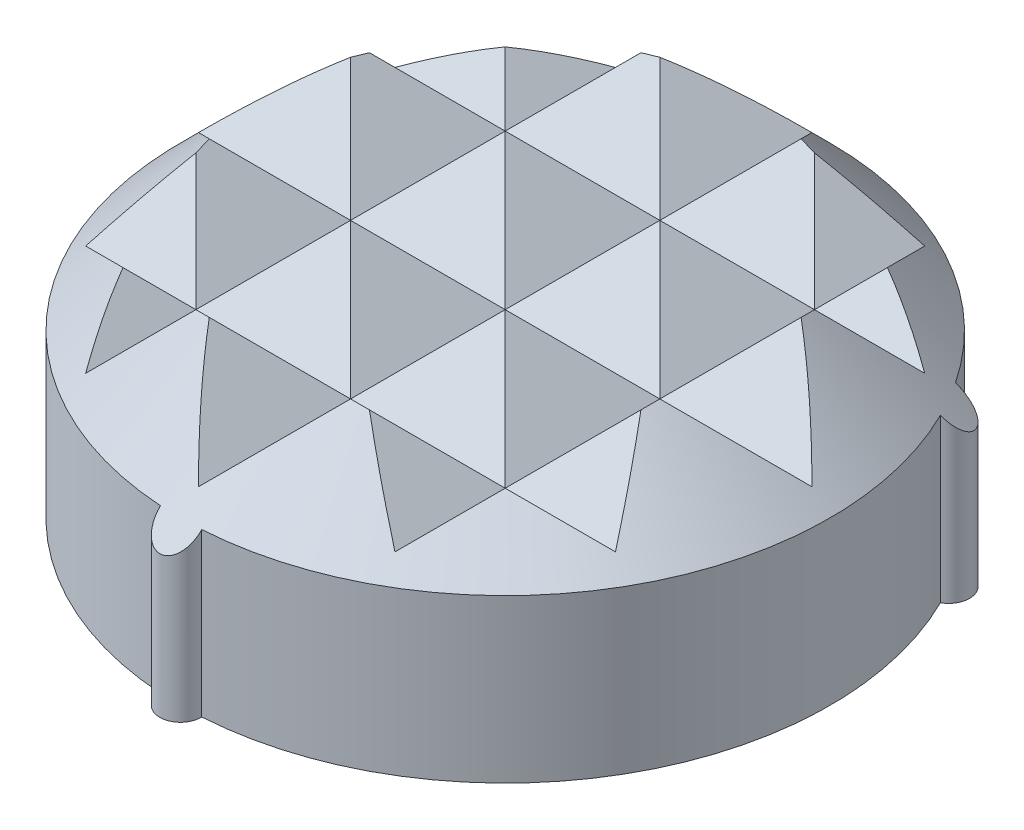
from build123d import *

# Parameters (mm, degrees)
SKETCH1_W             = 6.7
SKETCH1_H             = 5
SKETCH2_R             = 7.2
EXTRUDE1_DEPTH        = 11.713542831
EXTRUDE2_DEPTH        = 11.46804679
LPATTERN1_COUNT       = 8
LPATTERN1_PITCH       = 3
LPATTERN1_COUNT_DIR2  = 8
LPATTERN1_PITCH_DIR2  = 3
MIRROR1_COPY_1_DEPTH  = 11.46804679
MIRROR1_COPY_2_DEPTH  = 11.46804679
MIRROR1_COPY_3_DEPTH  = 11.46804679
MIRROR1_COPY_4_DEPTH  = 11.46804679
MIRROR1_COPY_5_DEPTH  = 11.46804679
MIRROR1_COPY_6_DEPTH  = 11.46804679
MIRROR1_COPY_7_DEPTH  = 11.46804679
MIRROR1_COPY_8_DEPTH  = 11.46804679
MIRROR1_COPY_9_DEPTH  = 11.46804679
MIRROR1_COPY_10_DEPTH = 11.46804679
MIRROR1_COPY_11_DEPTH = 11.46804679
MIRROR1_COPY_12_DEPTH = 11.46804679
MIRROR1_COPY_13_DEPTH = 11.46804679
MIRROR1_COPY_14_DEPTH = 11.46804679
MIRROR1_COPY_15_DEPTH = 11.46804679
MIRROR1_COPY_16_DEPTH = 11.46804679
MIRROR1_COPY_17_DEPTH = 11.46804679
MIRROR1_COPY_18_DEPTH = 11.46804679
MIRROR1_COPY_19_DEPTH = 11.46804679
MIRROR1_COPY_20_DEPTH = 11.46804679
MIRROR1_COPY_21_DEPTH = 11.46804679
MIRROR1_COPY_22_DEPTH = 11.46804679
MIRROR1_COPY_23_DEPTH = 11.46804679
MIRROR1_COPY_24_DEPTH = 11.46804679
MIRROR1_COPY_25_DEPTH = 11.46804679
MIRROR1_COPY_26_DEPTH = 11.46804679
MIRROR1_COPY_27_DEPTH = 11.46804679
MIRROR1_COPY_28_DEPTH = 11.46804679
MIRROR1_COPY_29_DEPTH = 11.46804679
MIRROR1_COPY_30_DEPTH = 11.46804679
MIRROR1_COPY_31_DEPTH = 11.46804679
MIRROR1_COPY_32_DEPTH = 11.46804679
MIRROR1_COPY_33_DEPTH = 11.46804679
MIRROR1_COPY_34_DEPTH = 11.46804679
MIRROR1_COPY_35_DEPTH = 11.46804679
MIRROR1_COPY_36_DEPTH = 11.46804679
MIRROR1_COPY_37_DEPTH = 11.46804679
MIRROR1_COPY_38_DEPTH = 11.46804679
MIRROR1_COPY_39_DEPTH = 11.46804679
MIRROR1_COPY_40_DEPTH = 11.46804679
MIRROR1_COPY_41_DEPTH = 11.46804679
MIRROR1_COPY_42_DEPTH = 11.46804679
MIRROR1_COPY_43_DEPTH = 11.46804679
MIRROR1_COPY_44_DEPTH = 11.46804679
MIRROR1_COPY_45_DEPTH = 11.46804679
MIRROR1_COPY_46_DEPTH = 11.46804679
MIRROR1_COPY_47_DEPTH = 11.46804679
MIRROR1_COPY_48_DEPTH = 11.46804679
MIRROR1_COPY_49_DEPTH = 11.46804679
MIRROR1_COPY_50_DEPTH = 11.46804679
MIRROR1_COPY_51_DEPTH = 11.46804679
MIRROR1_COPY_52_DEPTH = 11.46804679
MIRROR1_COPY_53_DEPTH = 11.46804679
MIRROR1_COPY_54_DEPTH = 11.46804679
MIRROR1_COPY_55_DEPTH = 11.46804679
MIRROR1_COPY_56_DEPTH = 11.46804679
MIRROR1_COPY_57_DEPTH = 11.46804679
MIRROR1_COPY_58_DEPTH = 11.46804679
MIRROR1_COPY_59_DEPTH = 11.46804679
MIRROR1_COPY_60_DEPTH = 11.46804679
MIRROR1_COPY_61_DEPTH = 11.46804679
MIRROR1_COPY_62_DEPTH = 11.46804679
MIRROR1_COPY_63_DEPTH = 11.46804679


with BuildPart() as part:
    # Sketch1 → Revolve1 (revolve)
    with BuildSketch(Plane.XY, mode=Mode.PRIVATE) as revolve1_sk:
        with Locations((3.35, 2.5)):
            Rectangle(SKETCH1_W, SKETCH1_H)
    revolve(revolve1_sk.sketch.rotate(Axis((0, 0, 0), (0, -1, 0)), 90), axis=Axis((0, 0, 0), (0, -1, 0)))

    # Sketch2 → Extrude1 (cut, through all)
    with BuildSketch(Plane(origin=(0, 0, 0), x_dir=(1, 0, 0), z_dir=(0, 1, 0))):
        Circle(SKETCH2_R)
        with BuildLine():
            ThreePointArc((0.399798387, -6.287301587), (5.455960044, -3.15), (5.644862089, 2.797415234))
            ThreePointArc((5.644862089, 2.797415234), (5.802370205, 3.35), (5.245063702, 3.489886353))
            ThreePointArc((5.245063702, 3.489886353), (0, 6.3), (-5.245063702, 3.489886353))
            ThreePointArc((-5.245063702, 3.489886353), (-5.802370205, 3.35), (-5.644862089, 2.797415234))
            ThreePointArc((-5.644862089, 2.797415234), (-5.455960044, -3.15), (-0.399798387, -6.287301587))
            ThreePointArc((-0.399798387, -6.287301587), (0, -6.7), (0.399798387, -6.287301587))
        make_face(mode=Mode.SUBTRACT)
    extrude(amount=EXTRUDE1_DEPTH, mode=Mode.SUBTRACT)

    # Sketch6 → Cut-Revolve1 (revolve, cut)
    with BuildSketch(Plane(origin=(0, 0, 0), x_dir=(0, 0, -1), z_dir=(1, 0, 0)), mode=Mode.PRIVATE) as cut_revolve1_sk:
        Polygon((-8.45, 1), (-8.45, 5), (-4.45, 5), align=None)
    revolve(cut_revolve1_sk.sketch.rotate(Axis((0, 0, 0), (0, 1, 0)), 180), axis=Axis((0, 0, 0), (0, 1, 0)), mode=Mode.SUBTRACT)

    # Sketch5 → Extrude2 (cut, symmetric)
    with BuildSketch(Plane.XY):
        Polygon((1.5, 5), (0, 3.5), (-1.5, 5), align=None)
    extrude2 = extrude(amount=EXTRUDE2_DEPTH, both=True, mode=Mode.SUBTRACT)

    # LPattern1: Extrude2 8 × 8
    with Locations(*[Vector(-1, 0, 0) * (i * LPATTERN1_PITCH) + Vector(1, 0, 0) * (j * LPATTERN1_PITCH_DIR2) for i in range(LPATTERN1_COUNT) for j in range(LPATTERN1_COUNT_DIR2) if (i, j) != (0, 0)]):
        add(extrude2, mode=Mode.SUBTRACT)

    # Mirror1: Extrude2 across plane
    add(extrude2.mirror(Plane(origin=(0, 0, 0), x_dir=(-0.7071067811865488, 0, 0.7071067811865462), z_dir=(0.7071067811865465, 0, 0.7071067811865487))), mode=Mode.SUBTRACT)

    # Mirror1 copy 1 sketch → Mirror1 copy 1 (cut, symmetric)
    with BuildSketch(Plane(origin=(0, 0, -3), x_dir=(0, 0, -1), z_dir=(-1, 0, 0))):
        Polygon((1.5, -5), (0, -3.5), (-1.5, -5), align=None)
    extrude(amount=MIRROR1_COPY_1_DEPTH, both=True, mode=Mode.SUBTRACT)

    # Mirror1 copy 2 sketch → Mirror1 copy 2 (cut, symmetric)
    with BuildSketch(Plane(origin=(0, 0, -6), x_dir=(0, 0, -1), z_dir=(-1, 0, 0))):
        Polygon((1.5, -5), (0, -3.5), (-1.5, -5), align=None)
    extrude(amount=MIRROR1_COPY_2_DEPTH, both=True, mode=Mode.SUBTRACT)

    # Mirror1 copy 3 sketch → Mirror1 copy 3 (cut, symmetric)
    with BuildSketch(Plane(origin=(0, 0, -9), x_dir=(0, 0, -1), z_dir=(-1, 0, 0))):
        Polygon((1.5, -5), (0, -3.5), (-1.5, -5), align=None)
    extrude(amount=MIRROR1_COPY_3_DEPTH, both=True, mode=Mode.SUBTRACT)

    # Mirror1 copy 4 sketch → Mirror1 copy 4 (cut, symmetric)
    with BuildSketch(Plane(origin=(0, 0, -12), x_dir=(0, 0, -1), z_dir=(-1, 0, 0))):
        Polygon((1.5, -5), (0, -3.5), (-1.5, -5), align=None)
    extrude(amount=MIRROR1_COPY_4_DEPTH, both=True, mode=Mode.SUBTRACT)

    # Mirror1 copy 5 sketch → Mirror1 copy 5 (cut, symmetric)
    with BuildSketch(Plane(origin=(0, 0, -15), x_dir=(0, 0, -1), z_dir=(-1, 0, 0))):
        Polygon((1.5, -5), (0, -3.5), (-1.5, -5), align=None)
    extrude(amount=MIRROR1_COPY_5_DEPTH, both=True, mode=Mode.SUBTRACT)

    # Mirror1 copy 6 sketch → Mirror1 copy 6 (cut, symmetric)
    with BuildSketch(Plane(origin=(0, 0, -18), x_dir=(0, 0, -1), z_dir=(-1, 0, 0))):
        Polygon((1.5, -5), (0, -3.5), (-1.5, -5), align=None)
    extrude(amount=MIRROR1_COPY_6_DEPTH, both=True, mode=Mode.SUBTRACT)

    # Mirror1 copy 7 sketch → Mirror1 copy 7 (cut, symmetric)
    with BuildSketch(Plane(origin=(0, 0, -21), x_dir=(0, 0, -1), z_dir=(-1, 0, 0))):
        Polygon((1.5, -5), (0, -3.5), (-1.5, -5), align=None)
    extrude(amount=MIRROR1_COPY_7_DEPTH, both=True, mode=Mode.SUBTRACT)

    # Mirror1 copy 8 sketch → Mirror1 copy 8 (cut, symmetric)
    with BuildSketch(Plane(origin=(0, 0, 3), x_dir=(0, 0, -1), z_dir=(-1, 0, 0))):
        Polygon((1.5, -5), (0, -3.5), (-1.5, -5), align=None)
    extrude(amount=MIRROR1_COPY_8_DEPTH, both=True, mode=Mode.SUBTRACT)

    # Mirror1 copy 9 sketch → Mirror1 copy 9 (cut, symmetric)
    with BuildSketch(Plane(origin=(0, 0, 0), x_dir=(0, 0, -1), z_dir=(-1, 0, 0))):
        Polygon((1.5, -5), (0, -3.5), (-1.5, -5), align=None)
    extrude(amount=MIRROR1_COPY_9_DEPTH, both=True, mode=Mode.SUBTRACT)

    # Mirror1 copy 10 sketch → Mirror1 copy 10 (cut, symmetric)
    with BuildSketch(Plane(origin=(0, 0, -3), x_dir=(0, 0, -1), z_dir=(-1, 0, 0))):
        Polygon((1.5, -5), (0, -3.5), (-1.5, -5), align=None)
    extrude(amount=MIRROR1_COPY_10_DEPTH, both=True, mode=Mode.SUBTRACT)

    # Mirror1 copy 11 sketch → Mirror1 copy 11 (cut, symmetric)
    with BuildSketch(Plane(origin=(0, 0, -6), x_dir=(0, 0, -1), z_dir=(-1, 0, 0))):
        Polygon((1.5, -5), (0, -3.5), (-1.5, -5), align=None)
    extrude(amount=MIRROR1_COPY_11_DEPTH, both=True, mode=Mode.SUBTRACT)

    # Mirror1 copy 12 sketch → Mirror1 copy 12 (cut, symmetric)
    with BuildSketch(Plane(origin=(0, 0, -9), x_dir=(0, 0, -1), z_dir=(-1, 0, 0))):
        Polygon((1.5, -5), (0, -3.5), (-1.5, -5), align=None)
    extrude(amount=MIRROR1_COPY_12_DEPTH, both=True, mode=Mode.SUBTRACT)

    # Mirror1 copy 13 sketch → Mirror1 copy 13 (cut, symmetric)
    with BuildSketch(Plane(origin=(0, 0, -12), x_dir=(0, 0, -1), z_dir=(-1, 0, 0))):
        Polygon((1.5, -5), (0, -3.5), (-1.5, -5), align=None)
    extrude(amount=MIRROR1_COPY_13_DEPTH, both=True, mode=Mode.SUBTRACT)

    # Mirror1 copy 14 sketch → Mirror1 copy 14 (cut, symmetric)
    with BuildSketch(Plane(origin=(0, 0, -15), x_dir=(0, 0, -1), z_dir=(-1, 0, 0))):
        Polygon((1.5, -5), (0, -3.5), (-1.5, -5), align=None)
    extrude(amount=MIRROR1_COPY_14_DEPTH, both=True, mode=Mode.SUBTRACT)

    # Mirror1 copy 15 sketch → Mirror1 copy 15 (cut, symmetric)
    with BuildSketch(Plane(origin=(0, 0, -18), x_dir=(0, 0, -1), z_dir=(-1, 0, 0))):
        Polygon((1.5, -5), (0, -3.5), (-1.5, -5), align=None)
    extrude(amount=MIRROR1_COPY_15_DEPTH, both=True, mode=Mode.SUBTRACT)

    # Mirror1 copy 16 sketch → Mirror1 copy 16 (cut, symmetric)
    with BuildSketch(Plane(origin=(0, 0, 6), x_dir=(0, 0, -1), z_dir=(-1, 0, 0))):
        Polygon((1.5, -5), (0, -3.5), (-1.5, -5), align=None)
    extrude(amount=MIRROR1_COPY_16_DEPTH, both=True, mode=Mode.SUBTRACT)

    # Mirror1 copy 17 sketch → Mirror1 copy 17 (cut, symmetric)
    with BuildSketch(Plane(origin=(0, 0, 3), x_dir=(0, 0, -1), z_dir=(-1, 0, 0))):
        Polygon((1.5, -5), (0, -3.5), (-1.5, -5), align=None)
    extrude(amount=MIRROR1_COPY_17_DEPTH, both=True, mode=Mode.SUBTRACT)

    # Mirror1 copy 18 sketch → Mirror1 copy 18 (cut, symmetric)
    with BuildSketch(Plane(origin=(0, 0, 0), x_dir=(0, 0, -1), z_dir=(-1, 0, 0))):
        Polygon((1.5, -5), (0, -3.5), (-1.5, -5), align=None)
    extrude(amount=MIRROR1_COPY_18_DEPTH, both=True, mode=Mode.SUBTRACT)

    # Mirror1 copy 19 sketch → Mirror1 copy 19 (cut, symmetric)
    with BuildSketch(Plane(origin=(0, 0, -3), x_dir=(0, 0, -1), z_dir=(-1, 0, 0))):
        Polygon((1.5, -5), (0, -3.5), (-1.5, -5), align=None)
    extrude(amount=MIRROR1_COPY_19_DEPTH, both=True, mode=Mode.SUBTRACT)

    # Mirror1 copy 20 sketch → Mirror1 copy 20 (cut, symmetric)
    with BuildSketch(Plane(origin=(0, 0, -6), x_dir=(0, 0, -1), z_dir=(-1, 0, 0))):
        Polygon((1.5, -5), (0, -3.5), (-1.5, -5), align=None)
    extrude(amount=MIRROR1_COPY_20_DEPTH, both=True, mode=Mode.SUBTRACT)

    # Mirror1 copy 21 sketch → Mirror1 copy 21 (cut, symmetric)
    with BuildSketch(Plane(origin=(0, 0, -9), x_dir=(0, 0, -1), z_dir=(-1, 0, 0))):
        Polygon((1.5, -5), (0, -3.5), (-1.5, -5), align=None)
    extrude(amount=MIRROR1_COPY_21_DEPTH, both=True, mode=Mode.SUBTRACT)

    # Mirror1 copy 22 sketch → Mirror1 copy 22 (cut, symmetric)
    with BuildSketch(Plane(origin=(0, 0, -12), x_dir=(0, 0, -1), z_dir=(-1, 0, 0))):
        Polygon((1.5, -5), (0, -3.5), (-1.5, -5), align=None)
    extrude(amount=MIRROR1_COPY_22_DEPTH, both=True, mode=Mode.SUBTRACT)

    # Mirror1 copy 23 sketch → Mirror1 copy 23 (cut, symmetric)
    with BuildSketch(Plane(origin=(0, 0, -15), x_dir=(0, 0, -1), z_dir=(-1, 0, 0))):
        Polygon((1.5, -5), (0, -3.5), (-1.5, -5), align=None)
    extrude(amount=MIRROR1_COPY_23_DEPTH, both=True, mode=Mode.SUBTRACT)

    # Mirror1 copy 24 sketch → Mirror1 copy 24 (cut, symmetric)
    with BuildSketch(Plane(origin=(0, 0, 9), x_dir=(0, 0, -1), z_dir=(-1, 0, 0))):
        Polygon((1.5, -5), (0, -3.5), (-1.5, -5), align=None)
    extrude(amount=MIRROR1_COPY_24_DEPTH, both=True, mode=Mode.SUBTRACT)

    # Mirror1 copy 25 sketch → Mirror1 copy 25 (cut, symmetric)
    with BuildSketch(Plane(origin=(0, 0, 6), x_dir=(0, 0, -1), z_dir=(-1, 0, 0))):
        Polygon((1.5, -5), (0, -3.5), (-1.5, -5), align=None)
    extrude(amount=MIRROR1_COPY_25_DEPTH, both=True, mode=Mode.SUBTRACT)

    # Mirror1 copy 26 sketch → Mirror1 copy 26 (cut, symmetric)
    with BuildSketch(Plane(origin=(0, 0, 3), x_dir=(0, 0, -1), z_dir=(-1, 0, 0))):
        Polygon((1.5, -5), (0, -3.5), (-1.5, -5), align=None)
    extrude(amount=MIRROR1_COPY_26_DEPTH, both=True, mode=Mode.SUBTRACT)

    # Mirror1 copy 27 sketch → Mirror1 copy 27 (cut, symmetric)
    with BuildSketch(Plane(origin=(0, 0, 0), x_dir=(0, 0, -1), z_dir=(-1, 0, 0))):
        Polygon((1.5, -5), (0, -3.5), (-1.5, -5), align=None)
    extrude(amount=MIRROR1_COPY_27_DEPTH, both=True, mode=Mode.SUBTRACT)

    # Mirror1 copy 28 sketch → Mirror1 copy 28 (cut, symmetric)
    with BuildSketch(Plane(origin=(0, 0, -3), x_dir=(0, 0, -1), z_dir=(-1, 0, 0))):
        Polygon((1.5, -5), (0, -3.5), (-1.5, -5), align=None)
    extrude(amount=MIRROR1_COPY_28_DEPTH, both=True, mode=Mode.SUBTRACT)

    # Mirror1 copy 29 sketch → Mirror1 copy 29 (cut, symmetric)
    with BuildSketch(Plane(origin=(0, 0, -6), x_dir=(0, 0, -1), z_dir=(-1, 0, 0))):
        Polygon((1.5, -5), (0, -3.5), (-1.5, -5), align=None)
    extrude(amount=MIRROR1_COPY_29_DEPTH, both=True, mode=Mode.SUBTRACT)

    # Mirror1 copy 30 sketch → Mirror1 copy 30 (cut, symmetric)
    with BuildSketch(Plane(origin=(0, 0, -9), x_dir=(0, 0, -1), z_dir=(-1, 0, 0))):
        Polygon((1.5, -5), (0, -3.5), (-1.5, -5), align=None)
    extrude(amount=MIRROR1_COPY_30_DEPTH, both=True, mode=Mode.SUBTRACT)

    # Mirror1 copy 31 sketch → Mirror1 copy 31 (cut, symmetric)
    with BuildSketch(Plane(origin=(0, 0, -12), x_dir=(0, 0, -1), z_dir=(-1, 0, 0))):
        Polygon((1.5, -5), (0, -3.5), (-1.5, -5), align=None)
    extrude(amount=MIRROR1_COPY_31_DEPTH, both=True, mode=Mode.SUBTRACT)

    # Mirror1 copy 32 sketch → Mirror1 copy 32 (cut, symmetric)
    with BuildSketch(Plane(origin=(0, 0, 12), x_dir=(0, 0, -1), z_dir=(-1, 0, 0))):
        Polygon((1.5, -5), (0, -3.5), (-1.5, -5), align=None)
    extrude(amount=MIRROR1_COPY_32_DEPTH, both=True, mode=Mode.SUBTRACT)

    # Mirror1 copy 33 sketch → Mirror1 copy 33 (cut, symmetric)
    with BuildSketch(Plane(origin=(0, 0, 9), x_dir=(0, 0, -1), z_dir=(-1, 0, 0))):
        Polygon((1.5, -5), (0, -3.5), (-1.5, -5), align=None)
    extrude(amount=MIRROR1_COPY_33_DEPTH, both=True, mode=Mode.SUBTRACT)

    # Mirror1 copy 34 sketch → Mirror1 copy 34 (cut, symmetric)
    with BuildSketch(Plane(origin=(0, 0, 6), x_dir=(0, 0, -1), z_dir=(-1, 0, 0))):
        Polygon((1.5, -5), (0, -3.5), (-1.5, -5), align=None)
    extrude(amount=MIRROR1_COPY_34_DEPTH, both=True, mode=Mode.SUBTRACT)

    # Mirror1 copy 35 sketch → Mirror1 copy 35 (cut, symmetric)
    with BuildSketch(Plane(origin=(0, 0, 3), x_dir=(0, 0, -1), z_dir=(-1, 0, 0))):
        Polygon((1.5, -5), (0, -3.5), (-1.5, -5), align=None)
    extrude(amount=MIRROR1_COPY_35_DEPTH, both=True, mode=Mode.SUBTRACT)

    # Mirror1 copy 36 sketch → Mirror1 copy 36 (cut, symmetric)
    with BuildSketch(Plane(origin=(0, 0, 0), x_dir=(0, 0, -1), z_dir=(-1, 0, 0))):
        Polygon((1.5, -5), (0, -3.5), (-1.5, -5), align=None)
    extrude(amount=MIRROR1_COPY_36_DEPTH, both=True, mode=Mode.SUBTRACT)

    # Mirror1 copy 37 sketch → Mirror1 copy 37 (cut, symmetric)
    with BuildSketch(Plane(origin=(0, 0, -3), x_dir=(0, 0, -1), z_dir=(-1, 0, 0))):
        Polygon((1.5, -5), (0, -3.5), (-1.5, -5), align=None)
    extrude(amount=MIRROR1_COPY_37_DEPTH, both=True, mode=Mode.SUBTRACT)

    # Mirror1 copy 38 sketch → Mirror1 copy 38 (cut, symmetric)
    with BuildSketch(Plane(origin=(0, 0, -6), x_dir=(0, 0, -1), z_dir=(-1, 0, 0))):
        Polygon((1.5, -5), (0, -3.5), (-1.5, -5), align=None)
    extrude(amount=MIRROR1_COPY_38_DEPTH, both=True, mode=Mode.SUBTRACT)

    # Mirror1 copy 39 sketch → Mirror1 copy 39 (cut, symmetric)
    with BuildSketch(Plane(origin=(0, 0, -9), x_dir=(0, 0, -1), z_dir=(-1, 0, 0))):
        Polygon((1.5, -5), (0, -3.5), (-1.5, -5), align=None)
    extrude(amount=MIRROR1_COPY_39_DEPTH, both=True, mode=Mode.SUBTRACT)

    # Mirror1 copy 40 sketch → Mirror1 copy 40 (cut, symmetric)
    with BuildSketch(Plane(origin=(0, 0, 15), x_dir=(0, 0, -1), z_dir=(-1, 0, 0))):
        Polygon((1.5, -5), (0, -3.5), (-1.5, -5), align=None)
    extrude(amount=MIRROR1_COPY_40_DEPTH, both=True, mode=Mode.SUBTRACT)

    # Mirror1 copy 41 sketch → Mirror1 copy 41 (cut, symmetric)
    with BuildSketch(Plane(origin=(0, 0, 12), x_dir=(0, 0, -1), z_dir=(-1, 0, 0))):
        Polygon((1.5, -5), (0, -3.5), (-1.5, -5), align=None)
    extrude(amount=MIRROR1_COPY_41_DEPTH, both=True, mode=Mode.SUBTRACT)

    # Mirror1 copy 42 sketch → Mirror1 copy 42 (cut, symmetric)
    with BuildSketch(Plane(origin=(0, 0, 9), x_dir=(0, 0, -1), z_dir=(-1, 0, 0))):
        Polygon((1.5, -5), (0, -3.5), (-1.5, -5), align=None)
    extrude(amount=MIRROR1_COPY_42_DEPTH, both=True, mode=Mode.SUBTRACT)

    # Mirror1 copy 43 sketch → Mirror1 copy 43 (cut, symmetric)
    with BuildSketch(Plane(origin=(0, 0, 6), x_dir=(0, 0, -1), z_dir=(-1, 0, 0))):
        Polygon((1.5, -5), (0, -3.5), (-1.5, -5), align=None)
    extrude(amount=MIRROR1_COPY_43_DEPTH, both=True, mode=Mode.SUBTRACT)

    # Mirror1 copy 44 sketch → Mirror1 copy 44 (cut, symmetric)
    with BuildSketch(Plane(origin=(0, 0, 3), x_dir=(0, 0, -1), z_dir=(-1, 0, 0))):
        Polygon((1.5, -5), (0, -3.5), (-1.5, -5), align=None)
    extrude(amount=MIRROR1_COPY_44_DEPTH, both=True, mode=Mode.SUBTRACT)

    # Mirror1 copy 45 sketch → Mirror1 copy 45 (cut, symmetric)
    with BuildSketch(Plane(origin=(0, 0, 0), x_dir=(0, 0, -1), z_dir=(-1, 0, 0))):
        Polygon((1.5, -5), (0, -3.5), (-1.5, -5), align=None)
    extrude(amount=MIRROR1_COPY_45_DEPTH, both=True, mode=Mode.SUBTRACT)

    # Mirror1 copy 46 sketch → Mirror1 copy 46 (cut, symmetric)
    with BuildSketch(Plane(origin=(0, 0, -3), x_dir=(0, 0, -1), z_dir=(-1, 0, 0))):
        Polygon((1.5, -5), (0, -3.5), (-1.5, -5), align=None)
    extrude(amount=MIRROR1_COPY_46_DEPTH, both=True, mode=Mode.SUBTRACT)

    # Mirror1 copy 47 sketch → Mirror1 copy 47 (cut, symmetric)
    with BuildSketch(Plane(origin=(0, 0, -6), x_dir=(0, 0, -1), z_dir=(-1, 0, 0))):
        Polygon((1.5, -5), (0, -3.5), (-1.5, -5), align=None)
    extrude(amount=MIRROR1_COPY_47_DEPTH, both=True, mode=Mode.SUBTRACT)

    # Mirror1 copy 48 sketch → Mirror1 copy 48 (cut, symmetric)
    with BuildSketch(Plane(origin=(0, 0, 18), x_dir=(0, 0, -1), z_dir=(-1, 0, 0))):
        Polygon((1.5, -5), (0, -3.5), (-1.5, -5), align=None)
    extrude(amount=MIRROR1_COPY_48_DEPTH, both=True, mode=Mode.SUBTRACT)

    # Mirror1 copy 49 sketch → Mirror1 copy 49 (cut, symmetric)
    with BuildSketch(Plane(origin=(0, 0, 15), x_dir=(0, 0, -1), z_dir=(-1, 0, 0))):
        Polygon((1.5, -5), (0, -3.5), (-1.5, -5), align=None)
    extrude(amount=MIRROR1_COPY_49_DEPTH, both=True, mode=Mode.SUBTRACT)

    # Mirror1 copy 50 sketch → Mirror1 copy 50 (cut, symmetric)
    with BuildSketch(Plane(origin=(0, 0, 12), x_dir=(0, 0, -1), z_dir=(-1, 0, 0))):
        Polygon((1.5, -5), (0, -3.5), (-1.5, -5), align=None)
    extrude(amount=MIRROR1_COPY_50_DEPTH, both=True, mode=Mode.SUBTRACT)

    # Mirror1 copy 51 sketch → Mirror1 copy 51 (cut, symmetric)
    with BuildSketch(Plane(origin=(0, 0, 9), x_dir=(0, 0, -1), z_dir=(-1, 0, 0))):
        Polygon((1.5, -5), (0, -3.5), (-1.5, -5), align=None)
    extrude(amount=MIRROR1_COPY_51_DEPTH, both=True, mode=Mode.SUBTRACT)

    # Mirror1 copy 52 sketch → Mirror1 copy 52 (cut, symmetric)
    with BuildSketch(Plane(origin=(0, 0, 6), x_dir=(0, 0, -1), z_dir=(-1, 0, 0))):
        Polygon((1.5, -5), (0, -3.5), (-1.5, -5), align=None)
    extrude(amount=MIRROR1_COPY_52_DEPTH, both=True, mode=Mode.SUBTRACT)

    # Mirror1 copy 53 sketch → Mirror1 copy 53 (cut, symmetric)
    with BuildSketch(Plane(origin=(0, 0, 3), x_dir=(0, 0, -1), z_dir=(-1, 0, 0))):
        Polygon((1.5, -5), (0, -3.5), (-1.5, -5), align=None)
    extrude(amount=MIRROR1_COPY_53_DEPTH, both=True, mode=Mode.SUBTRACT)

    # Mirror1 copy 54 sketch → Mirror1 copy 54 (cut, symmetric)
    with BuildSketch(Plane(origin=(0, 0, 0), x_dir=(0, 0, -1), z_dir=(-1, 0, 0))):
        Polygon((1.5, -5), (0, -3.5), (-1.5, -5), align=None)
    extrude(amount=MIRROR1_COPY_54_DEPTH, both=True, mode=Mode.SUBTRACT)

    # Mirror1 copy 55 sketch → Mirror1 copy 55 (cut, symmetric)
    with BuildSketch(Plane(origin=(0, 0, -3), x_dir=(0, 0, -1), z_dir=(-1, 0, 0))):
        Polygon((1.5, -5), (0, -3.5), (-1.5, -5), align=None)
    extrude(amount=MIRROR1_COPY_55_DEPTH, both=True, mode=Mode.SUBTRACT)

    # Mirror1 copy 56 sketch → Mirror1 copy 56 (cut, symmetric)
    with BuildSketch(Plane(origin=(0, 0, 21), x_dir=(0, 0, -1), z_dir=(-1, 0, 0))):
        Polygon((1.5, -5), (0, -3.5), (-1.5, -5), align=None)
    extrude(amount=MIRROR1_COPY_56_DEPTH, both=True, mode=Mode.SUBTRACT)

    # Mirror1 copy 57 sketch → Mirror1 copy 57 (cut, symmetric)
    with BuildSketch(Plane(origin=(0, 0, 18), x_dir=(0, 0, -1), z_dir=(-1, 0, 0))):
        Polygon((1.5, -5), (0, -3.5), (-1.5, -5), align=None)
    extrude(amount=MIRROR1_COPY_57_DEPTH, both=True, mode=Mode.SUBTRACT)

    # Mirror1 copy 58 sketch → Mirror1 copy 58 (cut, symmetric)
    with BuildSketch(Plane(origin=(0, 0, 15), x_dir=(0, 0, -1), z_dir=(-1, 0, 0))):
        Polygon((1.5, -5), (0, -3.5), (-1.5, -5), align=None)
    extrude(amount=MIRROR1_COPY_58_DEPTH, both=True, mode=Mode.SUBTRACT)

    # Mirror1 copy 59 sketch → Mirror1 copy 59 (cut, symmetric)
    with BuildSketch(Plane(origin=(0, 0, 12), x_dir=(0, 0, -1), z_dir=(-1, 0, 0))):
        Polygon((1.5, -5), (0, -3.5), (-1.5, -5), align=None)
    extrude(amount=MIRROR1_COPY_59_DEPTH, both=True, mode=Mode.SUBTRACT)

    # Mirror1 copy 60 sketch → Mirror1 copy 60 (cut, symmetric)
    with BuildSketch(Plane(origin=(0, 0, 9), x_dir=(0, 0, -1), z_dir=(-1, 0, 0))):
        Polygon((1.5, -5), (0, -3.5), (-1.5, -5), align=None)
    extrude(amount=MIRROR1_COPY_60_DEPTH, both=True, mode=Mode.SUBTRACT)

    # Mirror1 copy 61 sketch → Mirror1 copy 61 (cut, symmetric)
    with BuildSketch(Plane(origin=(0, 0, 6), x_dir=(0, 0, -1), z_dir=(-1, 0, 0))):
        Polygon((1.5, -5), (0, -3.5), (-1.5, -5), align=None)
    extrude(amount=MIRROR1_COPY_61_DEPTH, both=True, mode=Mode.SUBTRACT)

    # Mirror1 copy 62 sketch → Mirror1 copy 62 (cut, symmetric)
    with BuildSketch(Plane(origin=(0, 0, 3), x_dir=(0, 0, -1), z_dir=(-1, 0, 0))):
        Polygon((1.5, -5), (0, -3.5), (-1.5, -5), align=None)
    extrude(amount=MIRROR1_COPY_62_DEPTH, both=True, mode=Mode.SUBTRACT)

    # Mirror1 copy 63 sketch → Mirror1 copy 63 (cut, symmetric)
    with BuildSketch(Plane(origin=(0, 0, 0), x_dir=(0, 0, -1), z_dir=(-1, 0, 0))):
        Polygon((1.5, -5), (0, -3.5), (-1.5, -5), align=None)
    extrude(amount=MIRROR1_COPY_63_DEPTH, both=True, mode=Mode.SUBTRACT)


solid = part.part
